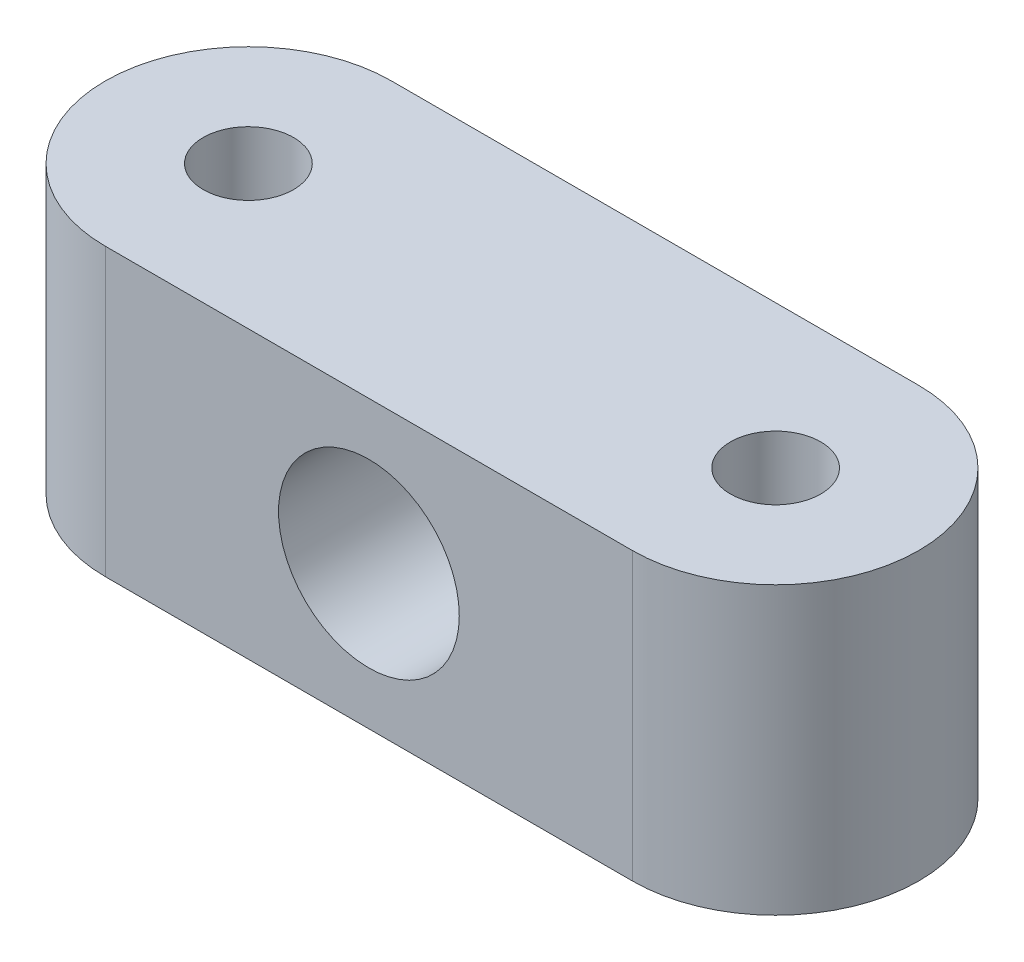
from build123d import *

# Parameters (mm, degrees)
SKETCH1_R               = 6
BOSS_EXTRUDE1_DEPTH     = 38
CUT_EXTRUDE1_DEPTH      = 104.966340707
CUT_EXTRUDE1_DEPTH_BACK = 104.966340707
SKETCH2_R               = 12


with BuildPart() as part:
    # Sketch1 → Boss-Extrude1 (new body)
    with BuildSketch(Plane(origin=(0, 0, 0), x_dir=(1, 0, 0), z_dir=(0, 1, 0))):
        with BuildLine():
            Line((0, 19), (70, 19))
            ThreePointArc((70, 19), (89, 0), (70, -19))
            Line((70, -19), (0, -19))
            ThreePointArc((0, -19), (-19, 0), (0, 19))
        make_face()
        with Locations(Location((0, 0, 0), (0, 0, 270))):
            Circle(SKETCH1_R, mode=Mode.SUBTRACT)
        with Locations(Location((70, 0, 0), (0, 0, 270))):
            Circle(SKETCH1_R, mode=Mode.SUBTRACT)
    extrude(amount=BOSS_EXTRUDE1_DEPTH)

    # Sketch2 → Cut-Extrude1 (cut, two sides: drawn at the far end of the back side and taken through both)
    with BuildSketch(Plane.XY.offset(19).offset(-CUT_EXTRUDE1_DEPTH_BACK)):
        with Locations((35, 19)):
            Circle(SKETCH2_R)
    extrude(amount=CUT_EXTRUDE1_DEPTH + CUT_EXTRUDE1_DEPTH_BACK, mode=Mode.SUBTRACT)


solid = part.part
